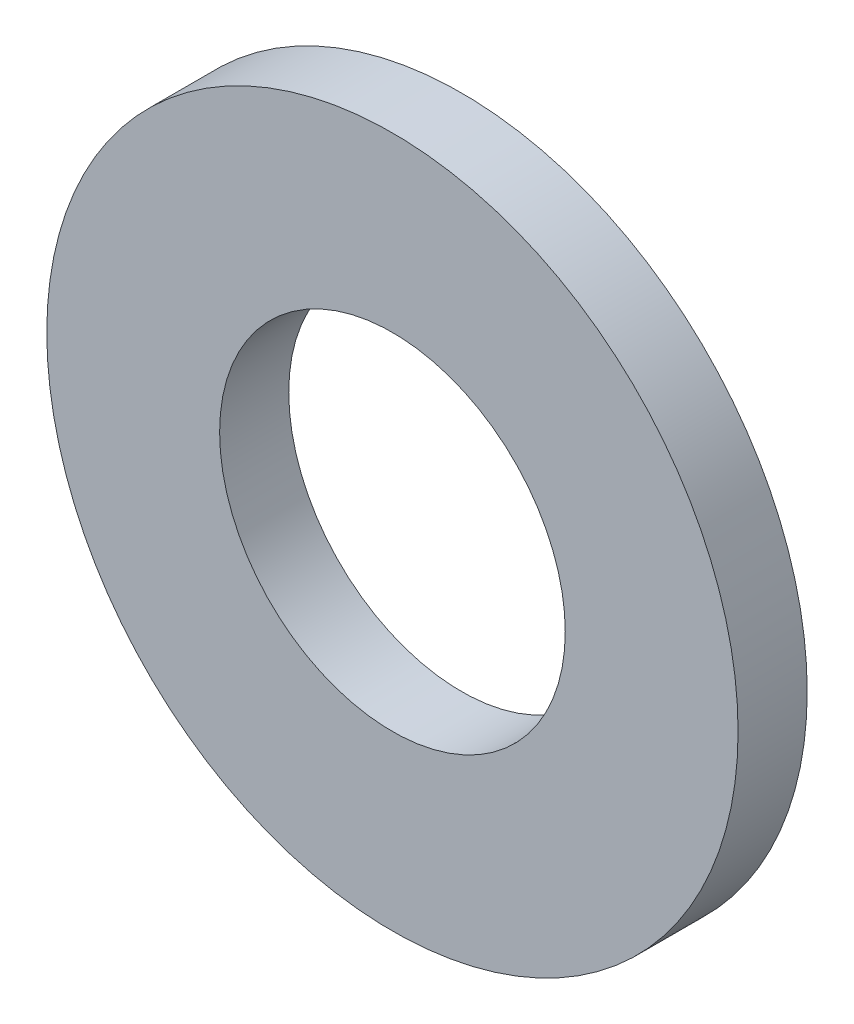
ISO-10303-21;
HEADER;
FILE_DESCRIPTION(('STEP AP214'),'2;1');
FILE_NAME('part.step','',(''),(''),'','','');
FILE_SCHEMA(('AUTOMOTIVE_DESIGN { 1 0 10303 214 1 1 1 1 }'));
ENDSEC;
DATA;
#1=APPLICATION_CONTEXT('core data for automotive mechanical design processes');
#2=APPLICATION_PROTOCOL_DEFINITION('international standard','automotive_design',2000,#1);
#3=PRODUCT_CONTEXT('',#1,'mechanical');
#4=PRODUCT('Part','Part','',(#3));
#5=PRODUCT_RELATED_PRODUCT_CATEGORY('part','',(#4));
#6=PRODUCT_DEFINITION_FORMATION('','',#4);
#7=PRODUCT_DEFINITION_CONTEXT('part definition',#1,'design');
#8=PRODUCT_DEFINITION('design','',#6,#7);
#9=PRODUCT_DEFINITION_SHAPE('','',#8);
#10=(LENGTH_UNIT() NAMED_UNIT(*) SI_UNIT(.MILLI.,.METRE.));
#11=(NAMED_UNIT(*) PLANE_ANGLE_UNIT() SI_UNIT($,.RADIAN.));
#12=(NAMED_UNIT(*) SI_UNIT($,.STERADIAN.) SOLID_ANGLE_UNIT());
#13=UNCERTAINTY_MEASURE_WITH_UNIT(LENGTH_MEASURE(1.E-05),#10,'distance_accuracy_value','');
#14=(GEOMETRIC_REPRESENTATION_CONTEXT(3) GLOBAL_UNCERTAINTY_ASSIGNED_CONTEXT((#13)) GLOBAL_UNIT_ASSIGNED_CONTEXT((#10,
#11,#12)) REPRESENTATION_CONTEXT('',''));
#15=CARTESIAN_POINT('',(0.,0.,0.));
#16=DIRECTION('',(0.,0.,1.));
#17=DIRECTION('',(1.,0.,0.));
#18=AXIS2_PLACEMENT_3D('',#15,#16,#17);
#19=CARTESIAN_POINT('',(296.5,145.,20.));
#20=DIRECTION('',(0.,0.,1.));
#21=DIRECTION('',(1.,0.,0.));
#22=AXIS2_PLACEMENT_3D('',#19,#20,#21);
#23=PLANE('',#22);
#24=CARTESIAN_POINT('',(296.5,145.,20.));
#25=DIRECTION('',(0.,0.,-1.));
#26=DIRECTION('',(-1.,0.,0.));
#27=AXIS2_PLACEMENT_3D('',#24,#25,#26);
#28=CIRCLE('',#27,4.);
#29=CARTESIAN_POINT('',(300.5,145.,20.));
#30=VERTEX_POINT('',#29);
#31=EDGE_CURVE('E33',#30,#30,#28,.F.);
#32=ORIENTED_EDGE('',*,*,#31,.T.);
#33=EDGE_LOOP('',(#32));
#34=FACE_BOUND('',#33,.T.);
#35=CARTESIAN_POINT('',(296.5,145.,20.));
#36=DIRECTION('',(0.,0.,1.));
#37=DIRECTION('',(1.,0.,0.));
#38=AXIS2_PLACEMENT_3D('',#35,#36,#37);
#39=CIRCLE('',#38,8.);
#40=CARTESIAN_POINT('',(288.5,145.,20.));
#41=VERTEX_POINT('',#40);
#42=EDGE_CURVE('E18',#41,#41,#39,.T.);
#43=ORIENTED_EDGE('',*,*,#42,.F.);
#44=EDGE_LOOP('',(#43));
#45=FACE_BOUND('',#44,.T.);
#46=ADVANCED_FACE('F15',(#34,#45),#23,.F.);
#47=CARTESIAN_POINT('',(296.5,145.,20.));
#48=DIRECTION('',(0.,0.,1.));
#49=DIRECTION('',(1.,0.,0.));
#50=AXIS2_PLACEMENT_3D('',#47,#48,#49);
#51=CYLINDRICAL_SURFACE('',#50,8.);
#52=CARTESIAN_POINT('',(296.5,145.,21.6));
#53=DIRECTION('',(0.,0.,1.));
#54=DIRECTION('',(1.,0.,0.));
#55=AXIS2_PLACEMENT_3D('',#52,#53,#54);
#56=CIRCLE('',#55,8.);
#57=CARTESIAN_POINT('',(288.5,145.,21.6));
#58=VERTEX_POINT('',#57);
#59=EDGE_CURVE('E23',#58,#58,#56,.T.);
#60=ORIENTED_EDGE('',*,*,#59,.F.);
#61=EDGE_LOOP('',(#60));
#62=FACE_BOUND('',#61,.T.);
#63=ORIENTED_EDGE('',*,*,#42,.T.);
#64=EDGE_LOOP('',(#63));
#65=FACE_BOUND('',#64,.T.);
#66=ADVANCED_FACE('F51',(#62,#65),#51,.T.);
#67=CARTESIAN_POINT('',(296.5,145.,21.6));
#68=DIRECTION('',(0.,0.,-1.));
#69=DIRECTION('',(-1.,0.,0.));
#70=AXIS2_PLACEMENT_3D('',#67,#68,#69);
#71=CYLINDRICAL_SURFACE('',#70,4.);
#72=CARTESIAN_POINT('',(296.5,145.,21.6));
#73=DIRECTION('',(0.,0.,-1.));
#74=DIRECTION('',(-1.,0.,0.));
#75=AXIS2_PLACEMENT_3D('',#72,#73,#74);
#76=CIRCLE('',#75,4.);
#77=CARTESIAN_POINT('',(300.5,145.,21.6));
#78=VERTEX_POINT('',#77);
#79=EDGE_CURVE('E10',#78,#78,#76,.T.);
#80=ORIENTED_EDGE('',*,*,#79,.F.);
#81=EDGE_LOOP('',(#80));
#82=FACE_BOUND('',#81,.T.);
#83=ORIENTED_EDGE('',*,*,#31,.F.);
#84=EDGE_LOOP('',(#83));
#85=FACE_BOUND('',#84,.T.);
#86=ADVANCED_FACE('F40',(#82,#85),#71,.F.);
#87=CARTESIAN_POINT('',(296.5,145.,21.6));
#88=DIRECTION('',(0.,0.,1.));
#89=DIRECTION('',(1.,0.,0.));
#90=AXIS2_PLACEMENT_3D('',#87,#88,#89);
#91=PLANE('',#90);
#92=ORIENTED_EDGE('',*,*,#79,.T.);
#93=EDGE_LOOP('',(#92));
#94=FACE_BOUND('',#93,.T.);
#95=ORIENTED_EDGE('',*,*,#59,.T.);
#96=EDGE_LOOP('',(#95));
#97=FACE_BOUND('',#96,.T.);
#98=ADVANCED_FACE('F43',(#94,#97),#91,.T.);
#99=CLOSED_SHELL('',(#46,#66,#86,#98));
#100=MANIFOLD_SOLID_BREP('B1',#99);
#101=ADVANCED_BREP_SHAPE_REPRESENTATION('',(#18,#100),#14);
#102=SHAPE_DEFINITION_REPRESENTATION(#9,#101);
ENDSEC;
END-ISO-10303-21;
